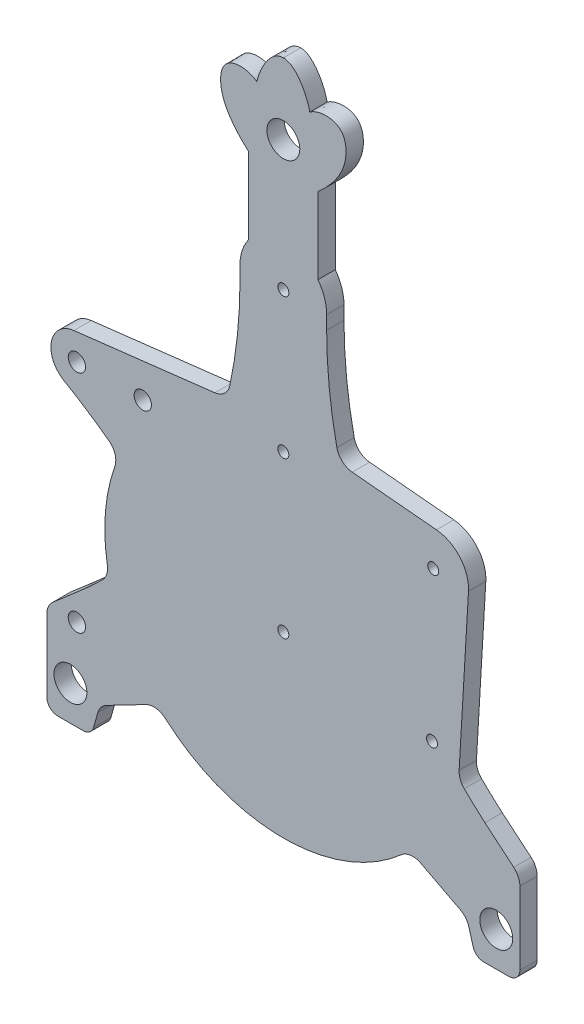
from build123d import *

# Parameters (mm, degrees)
SKETCH_1_R      = 9.5
SKETCH_1_R_2    = 5
SKETCH_1_R_3    = 3.175
EXTRUDE_1_DEPTH = 10


with BuildPart() as part:
    # Sketch 1 → Extrude 1 (new body)
    with BuildSketch(Plane.XY):
        with BuildLine():
            Line((-130.15, -107.13), (-115.602467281, -107.13))
            ThreePointArc((-115.602467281, -107.13), (-111.772096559, -105.844657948), (-109.492383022, -102.508979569))
            Line((-109.492383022, -102.508979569), (-107.05455814, -93.893889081))
            ThreePointArc((-107.05455814, -93.893889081), (-105.181823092, -90.296398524), (-102.034376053, -87.7385377))
            Line((-102.034376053, -87.7385377), (-79.302523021, -75.955464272))
            ThreePointArc((-79.302523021, -75.955464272), (-73.484807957, -74.907791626), (-68.091906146, -77.32854287))
            ThreePointArc((-68.091906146, -77.32854287), (0, -103.035), (68.091906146, -77.32854287))
            ThreePointArc((68.091906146, -77.32854287), (73.484807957, -74.907791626), (79.302523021, -75.955464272))
            Line((79.302523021, -75.955464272), (102.034376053, -87.7385377))
            ThreePointArc((102.034376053, -87.7385377), (105.181823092, -90.296398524), (107.05455814, -93.893889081))
            Line((107.05455814, -93.893889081), (109.492383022, -102.508979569))
            ThreePointArc((109.492383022, -102.508979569), (111.772096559, -105.844657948), (115.602467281, -107.13))
            Line((115.602467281, -107.13), (130.15, -107.13))
            ThreePointArc((130.15, -107.13), (134.640128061, -105.270128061), (136.5, -100.78))
            Line((136.5, -100.78), (136.5, -58.792277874))
            ThreePointArc((136.5, -58.792277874), (135.56335512, -54.56668987), (132.928881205, -51.132676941))
            Line((132.928881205, -51.132676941), (116.326646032, -37.198034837))
            ThreePointArc((116.326646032, -37.198034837), (110.282226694, -31.779283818), (104.40627406, -26.178297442))
            ThreePointArc((104.40627406, -26.178297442), (102.084404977, -22.641376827), (101.432936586, -18.460889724))
            Line((101.432936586, -18.460889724), (106.837059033, 73.70830993))
            ThreePointArc((106.837059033, 73.70830993), (101.949219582, 88.18346672), (88.374512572, 95.194063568))
            Line((88.374512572, 95.194063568), (39.747747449, 99.705032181))
            ThreePointArc((39.747747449, 99.705032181), (34.031800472, 102.184645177), (30.893401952, 107.567115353))
            ThreePointArc((30.893401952, 107.567115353), (26.477460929, 135.227915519), (25, 163.2))
            Line((25, 163.2), (25, 171))
            ThreePointArc((25, 171), (23.717082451, 178.90569415), (20, 186))
            Line((20, 186), (20, 230.002))
            add(Edge.make_bspline(
                [(15.24, 267.326), (19.195889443, 270.473460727), (28.324498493, 271.683289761), (35.523161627, 265.096664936), (38.251589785, 249.058267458), (27.773000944, 236.866062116), (20, 230.002)],
                knots=[0, 0, 0, 0, 0.265880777, 0.312688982, 0.468082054, 1, 1, 1, 1], degree=3))
            add(Edge.make_bspline(
                [(0, 286.87), (8.941989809, 286.87), (14.912840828, 270.825696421), (15.24, 267.326)],
                knots=[0, 0, 0, 0, 1, 1, 1, 1], degree=3))
            add(Edge.make_bspline(
                [(0, 286.87), (-8.941989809, 286.87), (-14.912840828, 270.825696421), (-15.24, 267.326)],
                knots=[0, 0, 0, 0, 1, 1, 1, 1], degree=3))
            add(Edge.make_bspline(
                [(-15.24, 267.326), (-19.195889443, 270.473460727), (-28.324498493, 271.683289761), (-35.523161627, 265.096664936), (-38.251589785, 249.058267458), (-27.773000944, 236.866062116), (-20, 230.002)],
                knots=[0, 0, 0, 0, 0.265880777, 0.312688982, 0.468082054, 1, 1, 1, 1], degree=3))
            Line((-20, 230.002), (-20, 186))
            ThreePointArc((-20, 186), (-23.717082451, 178.90569415), (-25, 171))
            Line((-25, 171), (-25, 163.2))
            ThreePointArc((-25, 163.2), (-26.477460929, 135.227915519), (-30.893401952, 107.567115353))
            ThreePointArc((-30.893401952, 107.567115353), (-33.941175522, 102.266107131), (-39.505373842, 99.730498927))
            Line((-39.505373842, 99.730498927), (-120.869119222, 90.177670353))
            ThreePointArc((-120.869119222, 90.177670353), (-133.812167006, 78.30328111), (-126.609079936, 62.283320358))
            ThreePointArc((-126.609079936, 62.283320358), (-112.869751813, 53.799639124), (-99.671502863, 44.496510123))
            ThreePointArc((-99.671502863, 44.496510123), (-96.941058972, 39.630404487), (-97.243053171, 34.058770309))
            ThreePointArc((-97.243053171, 34.058770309), (-102.673592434, 8.622333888), (-101.561402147, -17.363548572))
            ThreePointArc((-101.561402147, -17.363548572), (-101.902320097, -22.121955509), (-104.408966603, -26.180943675))
            ThreePointArc((-104.408966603, -26.180943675), (-110.283612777, -31.780565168), (-116.326646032, -37.198034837))
            Line((-116.326646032, -37.198034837), (-133.06059029, -51.744630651))
            ThreePointArc((-133.06059029, -51.744630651), (-135.599612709, -55.144794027), (-136.5, -59.291726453))
            Line((-136.5, -59.291726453), (-136.5, -100.78))
            ThreePointArc((-136.5, -100.78), (-134.640128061, -105.270128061), (-130.15, -107.13))
        make_face()
        with Locations((-122.85, -87.13)):
            Circle(SKETCH_1_R, mode=Mode.SUBTRACT)
        with Locations((122.85, -87.13)):
            Circle(SKETCH_1_R, mode=Mode.SUBTRACT)
        with Locations((-119.12, -54.72)):
            Circle(SKETCH_1_R_2, mode=Mode.SUBTRACT)
        with Locations((-119.12, 75.28)):
            Circle(SKETCH_1_R_2, mode=Mode.SUBTRACT)
        with Locations((-81.12, 75.28)):
            Circle(SKETCH_1_R_2, mode=Mode.SUBTRACT)
        Circle(SKETCH_1_R_3, mode=Mode.SUBTRACT)
        with Locations((0, 90)):
            Circle(SKETCH_1_R_3, mode=Mode.SUBTRACT)
        with Locations((86.492, 74.901194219)):
            Circle(SKETCH_1_R_3, mode=Mode.SUBTRACT)
        with Locations((85.806534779, -11.696092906)):
            Circle(SKETCH_1_R_3, mode=Mode.SUBTRACT)
        with Locations((0, 171)):
            Circle(SKETCH_1_R_3, mode=Mode.SUBTRACT)
        with Locations((0, 246)):
            Circle(SKETCH_1_R, mode=Mode.SUBTRACT)
    extrude(amount=EXTRUDE_1_DEPTH)


solid = part.part
